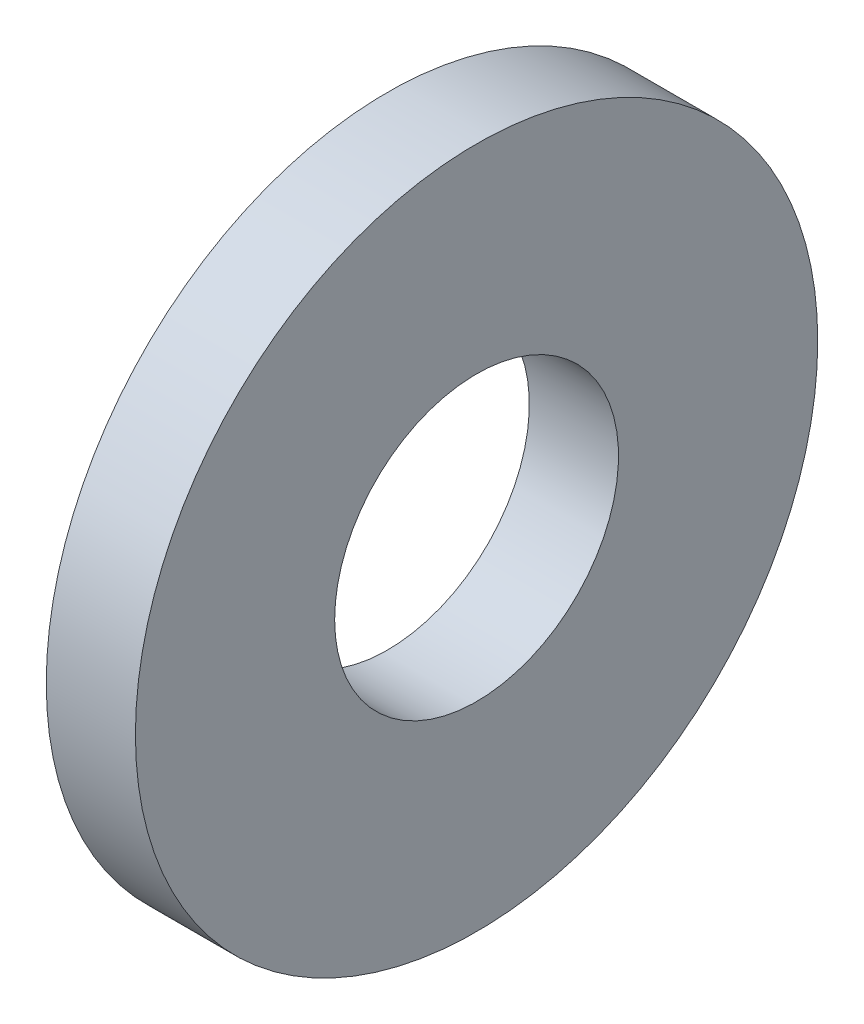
ISO-10303-21;
HEADER;
FILE_DESCRIPTION(('STEP AP214'),'2;1');
FILE_NAME('part.step','',(''),(''),'','','');
FILE_SCHEMA(('AUTOMOTIVE_DESIGN { 1 0 10303 214 1 1 1 1 }'));
ENDSEC;
DATA;
#1=APPLICATION_CONTEXT('core data for automotive mechanical design processes');
#2=APPLICATION_PROTOCOL_DEFINITION('international standard','automotive_design',2000,#1);
#3=PRODUCT_CONTEXT('',#1,'mechanical');
#4=PRODUCT('Part','Part','',(#3));
#5=PRODUCT_RELATED_PRODUCT_CATEGORY('part','',(#4));
#6=PRODUCT_DEFINITION_FORMATION('','',#4);
#7=PRODUCT_DEFINITION_CONTEXT('part definition',#1,'design');
#8=PRODUCT_DEFINITION('design','',#6,#7);
#9=PRODUCT_DEFINITION_SHAPE('','',#8);
#10=(LENGTH_UNIT() NAMED_UNIT(*) SI_UNIT(.MILLI.,.METRE.));
#11=(NAMED_UNIT(*) PLANE_ANGLE_UNIT() SI_UNIT($,.RADIAN.));
#12=(NAMED_UNIT(*) SI_UNIT($,.STERADIAN.) SOLID_ANGLE_UNIT());
#13=UNCERTAINTY_MEASURE_WITH_UNIT(LENGTH_MEASURE(1.E-05),#10,'distance_accuracy_value','');
#14=(GEOMETRIC_REPRESENTATION_CONTEXT(3) GLOBAL_UNCERTAINTY_ASSIGNED_CONTEXT((#13)) GLOBAL_UNIT_ASSIGNED_CONTEXT((#10,
#11,#12)) REPRESENTATION_CONTEXT('',''));
#15=CARTESIAN_POINT('',(0.,0.,0.));
#16=DIRECTION('',(0.,0.,1.));
#17=DIRECTION('',(1.,0.,0.));
#18=AXIS2_PLACEMENT_3D('',#15,#16,#17);
#19=CARTESIAN_POINT('',(-34.9249999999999,0.,0.));
#20=DIRECTION('',(-1.,0.,0.));
#21=DIRECTION('',(0.,0.,1.));
#22=AXIS2_PLACEMENT_3D('',#19,#20,#21);
#23=CYLINDRICAL_SURFACE('',#22,1.9812);
#24=CARTESIAN_POINT('',(0.,0.,0.));
#25=DIRECTION('',(-1.,0.,0.));
#26=DIRECTION('',(0.,0.,1.));
#27=AXIS2_PLACEMENT_3D('',#24,#25,#26);
#28=CIRCLE('',#27,1.9812);
#29=CARTESIAN_POINT('',(0.,0.,1.9812));
#30=VERTEX_POINT('',#29);
#31=EDGE_CURVE('E10',#30,#30,#28,.T.);
#32=ORIENTED_EDGE('',*,*,#31,.F.);
#33=EDGE_LOOP('',(#32));
#34=FACE_BOUND('',#33,.T.);
#35=CARTESIAN_POINT('',(-1.2446,0.,0.));
#36=DIRECTION('',(-1.,0.,0.));
#37=DIRECTION('',(0.,0.,1.));
#38=AXIS2_PLACEMENT_3D('',#35,#36,#37);
#39=CIRCLE('',#38,1.9812);
#40=CARTESIAN_POINT('',(-1.2446,0.,1.9812));
#41=VERTEX_POINT('',#40);
#42=EDGE_CURVE('E40',#41,#41,#39,.T.);
#43=ORIENTED_EDGE('',*,*,#42,.T.);
#44=EDGE_LOOP('',(#43));
#45=FACE_BOUND('',#44,.T.);
#46=ADVANCED_FACE('F26',(#34,#45),#23,.F.);
#47=CARTESIAN_POINT('',(0.,1.9812,0.));
#48=DIRECTION('',(-1.,0.,0.));
#49=DIRECTION('',(0.,0.,1.));
#50=AXIS2_PLACEMENT_3D('',#47,#48,#49);
#51=PLANE('',#50);
#52=CARTESIAN_POINT('',(0.,0.,0.));
#53=DIRECTION('',(-1.,0.,0.));
#54=DIRECTION('',(0.,0.,1.));
#55=AXIS2_PLACEMENT_3D('',#52,#53,#54);
#56=CIRCLE('',#55,4.7625);
#57=CARTESIAN_POINT('',(0.,0.,4.7625));
#58=VERTEX_POINT('',#57);
#59=EDGE_CURVE('E32',#58,#58,#56,.T.);
#60=ORIENTED_EDGE('',*,*,#59,.F.);
#61=EDGE_LOOP('',(#60));
#62=FACE_BOUND('',#61,.T.);
#63=ORIENTED_EDGE('',*,*,#31,.T.);
#64=EDGE_LOOP('',(#63));
#65=FACE_BOUND('',#64,.T.);
#66=ADVANCED_FACE('F55',(#62,#65),#51,.F.);
#67=CARTESIAN_POINT('',(-34.9249999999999,0.,0.));
#68=DIRECTION('',(-1.,0.,0.));
#69=DIRECTION('',(0.,0.,1.));
#70=AXIS2_PLACEMENT_3D('',#67,#68,#69);
#71=CYLINDRICAL_SURFACE('',#70,4.7625);
#72=CARTESIAN_POINT('',(-1.2446,0.,0.));
#73=DIRECTION('',(-1.,0.,0.));
#74=DIRECTION('',(0.,0.,1.));
#75=AXIS2_PLACEMENT_3D('',#72,#73,#74);
#76=CIRCLE('',#75,4.7625);
#77=CARTESIAN_POINT('',(-1.2446,0.,4.7625));
#78=VERTEX_POINT('',#77);
#79=EDGE_CURVE('E36',#78,#78,#76,.T.);
#80=ORIENTED_EDGE('',*,*,#79,.F.);
#81=EDGE_LOOP('',(#80));
#82=FACE_BOUND('',#81,.T.);
#83=ORIENTED_EDGE('',*,*,#59,.T.);
#84=EDGE_LOOP('',(#83));
#85=FACE_BOUND('',#84,.T.);
#86=ADVANCED_FACE('F50',(#82,#85),#71,.T.);
#87=CARTESIAN_POINT('',(-1.2446,4.7625,0.));
#88=DIRECTION('',(1.,0.,0.));
#89=DIRECTION('',(0.,0.,-1.));
#90=AXIS2_PLACEMENT_3D('',#87,#88,#89);
#91=PLANE('',#90);
#92=ORIENTED_EDGE('',*,*,#42,.F.);
#93=EDGE_LOOP('',(#92));
#94=FACE_BOUND('',#93,.T.);
#95=ORIENTED_EDGE('',*,*,#79,.T.);
#96=EDGE_LOOP('',(#95));
#97=FACE_BOUND('',#96,.T.);
#98=ADVANCED_FACE('F47',(#94,#97),#91,.F.);
#99=CLOSED_SHELL('',(#46,#66,#86,#98));
#100=MANIFOLD_SOLID_BREP('B2',#99);
#101=ADVANCED_BREP_SHAPE_REPRESENTATION('',(#18,#100),#14);
#102=SHAPE_DEFINITION_REPRESENTATION(#9,#101);
ENDSEC;
END-ISO-10303-21;
